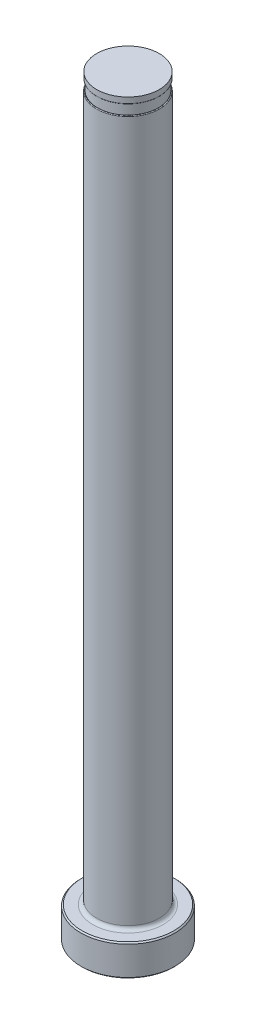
from build123d import *

# Parameters (mm, degrees)
CHAMFER1_SIZE     = 0.254
FILLET1_R         = 0.762
SKETCH2_W         = 0.2032
SKETCH2_H         = 2.032
D_SLOT_DEPTH      = 153.9941543
D_SLOT_DEPTH_BACK = 153.9941543
SKETCH5_W         = 0.01905
SKETCH5_H         = 1.27
FILLET2_R         = 0.127


with BuildPart() as part:
    # Sketch1 → Revolve1 (revolve)
    with BuildSketch(Plane.XY, mode=Mode.PRIVATE) as revolve1_sk:
        Polygon((0, 0), (-9.525, 0), (-9.525, 6.35), (-6.35, 6.35), (-6.35, 152.4), (0, 152.4), align=None)
    revolve(revolve1_sk.sketch.rotate(Axis((0, 259.958771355, 0), (0, -1, 0)), 270), axis=Axis((0, 259.958771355, 0), (0, -1, 0)))

    # Chamfer1
    chamfer1_edges = [part.edges().sort_by_distance(p)[0] for p in [
        (0, 6.35, -9.525),
        (0, 0, -9.525),
    ]]
    chamfer(chamfer1_edges, length=CHAMFER1_SIZE)

    # Fillet1
    fillet1_edges = [part.edges().sort_by_distance(p)[0] for p in [
        (0, 6.35, -6.35),
    ]]
    fillet(fillet1_edges, radius=FILLET1_R)

    # Sketch2 → Vent Relief (revolve, cut)
    with BuildSketch(Plane.XY, mode=Mode.PRIVATE) as vent_relief_sk:
        with Locations((-6.2484, 150.114)):
            Rectangle(SKETCH2_W, SKETCH2_H)
    revolve(vent_relief_sk.sketch.rotate(Axis((0, 153.448281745, 0), (0, -1, 0)), 270), axis=Axis((0, 153.448281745, 0), (0, -1, 0)), mode=Mode.SUBTRACT)

    # Sketch3 → D-Slot (cut, two sides: drawn at the far end of the back side and taken through both)
    with BuildSketch(Plane.XY.offset(-D_SLOT_DEPTH_BACK)):
        with BuildLine():
            Line((-6.1468, 150.114), (-6.1468, 86.614))
            ThreePointArc((-6.1468, 86.614), (-6.198013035, 86.046038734), (-6.35, 85.4964))
            Line((-6.35, 85.4964), (-6.35, 150.114))
            Line((-6.35, 150.114), (-6.1468, 150.114))
        make_face()
    extrude(amount=D_SLOT_DEPTH + D_SLOT_DEPTH_BACK, mode=Mode.SUBTRACT)

    # Sketch5 → Vent Diameter (revolve, cut)
    with BuildSketch(Plane.XY, mode=Mode.PRIVATE) as vent_diameter_sk:
        with Locations((-6.340475, 151.765)):
            Rectangle(SKETCH5_W, SKETCH5_H)
    revolve(vent_diameter_sk.sketch.rotate(Axis((0, 152.687735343, 0), (0, -1, 0)), 90), axis=Axis((0, 152.687735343, 0), (0, -1, 0)), mode=Mode.SUBTRACT)

    # Fillet2
    fillet2_edges = [part.edges().sort_by_distance(p)[0] for p in [
        (5.022023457, 149.098, -3.886100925),
        (0, 151.13, 6.33095),
    ]]
    fillet(fillet2_edges, radius=FILLET2_R)


solid = part.part
